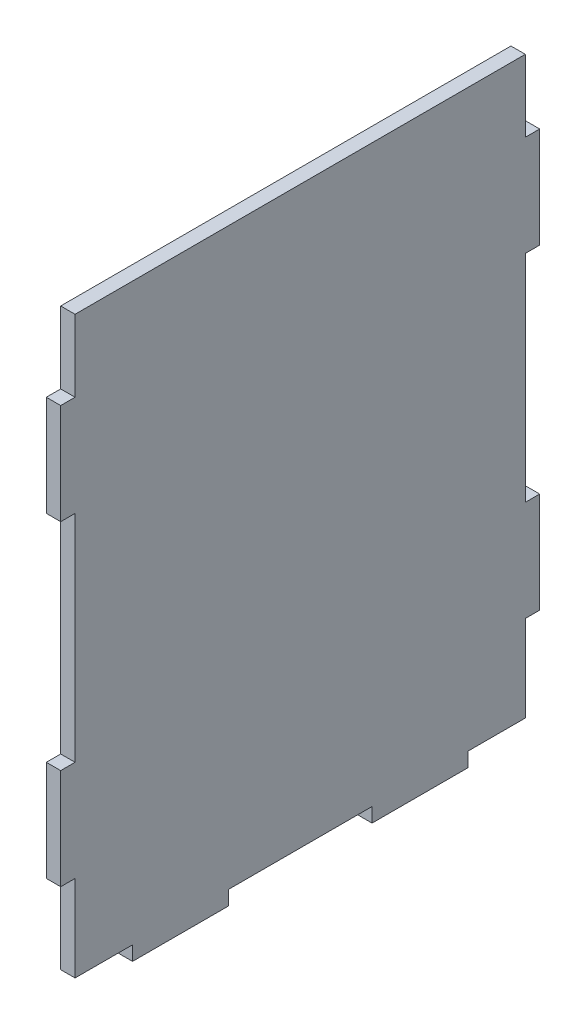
from build123d import *

# Parameters (mm, degrees)
SKETCH_1_W          = 100
SKETCH_1_H          = 120
EXTRUDE_1_DEPTH     = 3
SKETCH_2_W          = 3
SKETCH_2_H          = 45
SKETCH_2_H_2        = 18
SKETCH_2_H_3        = 15
CUT_EXTRUDE_2_DEPTH = 3
SKETCH_4_W          = 20
SKETCH_4_H          = 3
EXTRUDE_3_DEPTH     = 3


with BuildPart() as part:
    # Sketch 1 → Extrude 1 (new body)
    with BuildSketch(Plane(origin=(0, 0, 0), x_dir=(0, 0, -1), z_dir=(1, 0, 0))):
        Rectangle(SKETCH_1_W, SKETCH_1_H)
    extrude(amount=EXTRUDE_1_DEPTH)

    # Sketch 2 → Cut-Extrude 2 (cut)
    with BuildSketch(Plane(origin=(3, 0, 0), x_dir=(0, 0, -1), z_dir=(1, 0, 0))):
        with Locations((48.5, 1.5)):
            Rectangle(SKETCH_2_W, SKETCH_2_H)
        with Locations((48.5, -51)):
            Rectangle(SKETCH_2_W, SKETCH_2_H_2)
        with Locations((48.5, 52.5)):
            Rectangle(SKETCH_2_W, SKETCH_2_H_3)
        with Locations((-48.5, 52.5)):
            Rectangle(SKETCH_2_W, SKETCH_2_H_3)
        with Locations((-48.5, -51)):
            Rectangle(SKETCH_2_W, SKETCH_2_H_2)
        with Locations((-48.5, 1.5)):
            Rectangle(SKETCH_2_W, SKETCH_2_H)
    extrude(amount=-CUT_EXTRUDE_2_DEPTH, mode=Mode.SUBTRACT)

    # Sketch 4 → Extrude 3 (add)
    with BuildSketch(Plane(origin=(3, 0, 0), x_dir=(0, 0, -1), z_dir=(1, 0, 0))):
        with Locations((-25, -61.5)):
            Rectangle(SKETCH_4_W, SKETCH_4_H)
        with Locations((25, -61.5)):
            Rectangle(SKETCH_4_W, SKETCH_4_H)
    extrude(amount=-EXTRUDE_3_DEPTH)


solid = part.part
